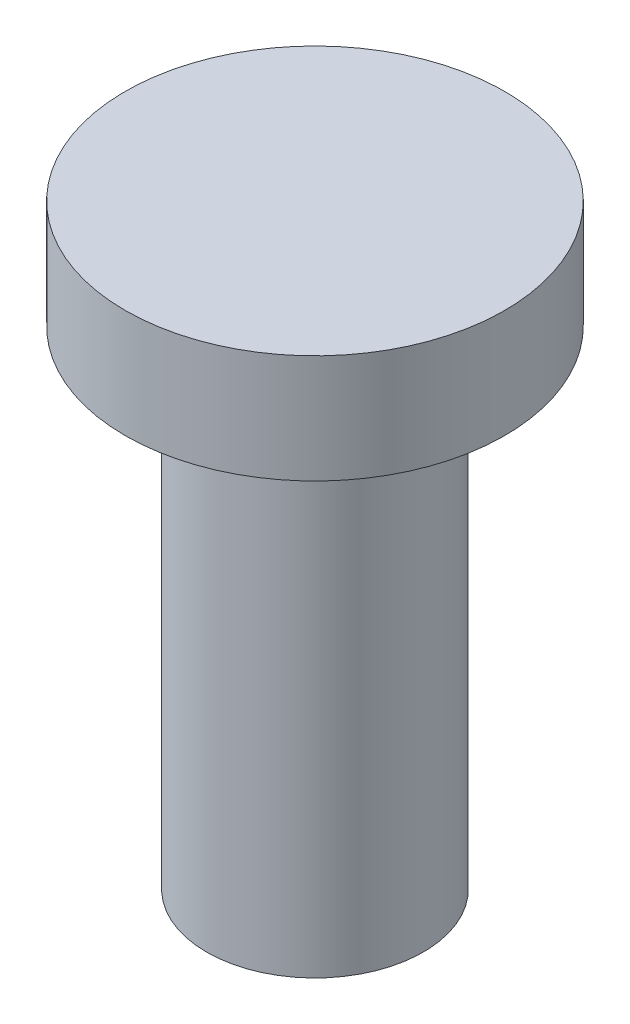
from build123d import *


with BuildPart() as part:
    # Szkic1 → Obr_t1 (revolve)
    with BuildSketch(Plane.XY, mode=Mode.PRIVATE) as obr_t1_sk:
        Polygon((0, 0), (-10, 0), (-10, 45), (-17.5, 45), (-17.5, 55), (0, 55), align=None)
    revolve(obr_t1_sk.sketch.rotate(Axis((0, 0, 0), (0, -1, 0)), 270), axis=Axis((0, 0, 0), (0, -1, 0)))


solid = part.part
